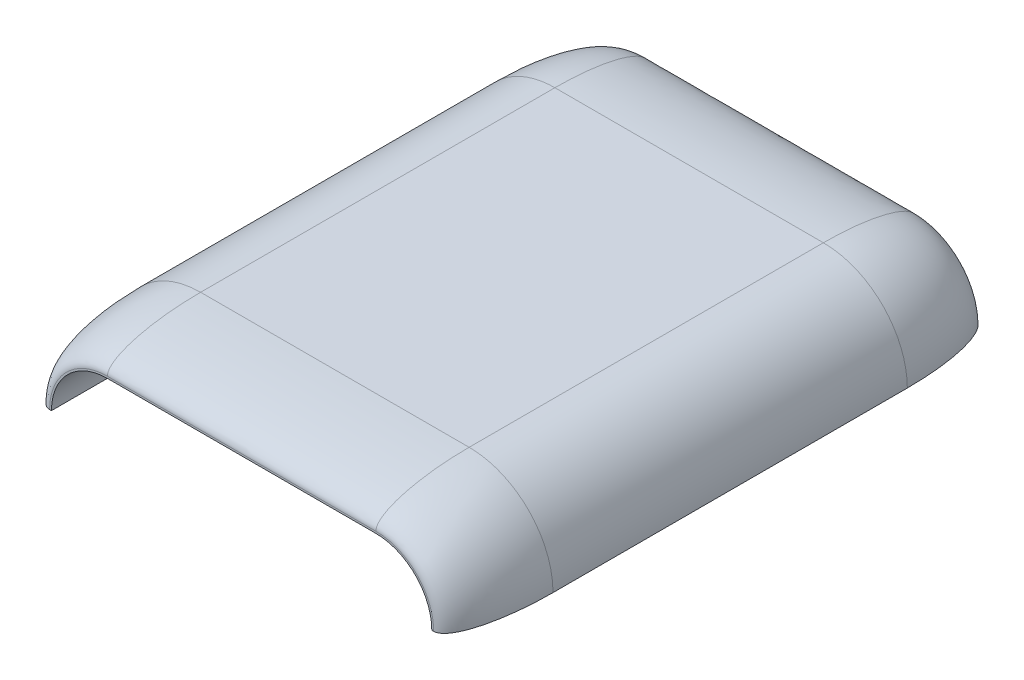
ISO-10303-21;
HEADER;
FILE_DESCRIPTION(('STEP AP214'),'2;1');
FILE_NAME('part.step','',(''),(''),'','','');
FILE_SCHEMA(('AUTOMOTIVE_DESIGN { 1 0 10303 214 1 1 1 1 }'));
ENDSEC;
DATA;
#1=APPLICATION_CONTEXT('core data for automotive mechanical design processes');
#2=APPLICATION_PROTOCOL_DEFINITION('international standard','automotive_design',2000,#1);
#3=PRODUCT_CONTEXT('',#1,'mechanical');
#4=PRODUCT('Part','Part','',(#3));
#5=PRODUCT_RELATED_PRODUCT_CATEGORY('part','',(#4));
#6=PRODUCT_DEFINITION_FORMATION('','',#4);
#7=PRODUCT_DEFINITION_CONTEXT('part definition',#1,'design');
#8=PRODUCT_DEFINITION('design','',#6,#7);
#9=PRODUCT_DEFINITION_SHAPE('','',#8);
#10=(LENGTH_UNIT() NAMED_UNIT(*) SI_UNIT(.MILLI.,.METRE.));
#11=(NAMED_UNIT(*) PLANE_ANGLE_UNIT() SI_UNIT($,.RADIAN.));
#12=(NAMED_UNIT(*) SI_UNIT($,.STERADIAN.) SOLID_ANGLE_UNIT());
#13=UNCERTAINTY_MEASURE_WITH_UNIT(LENGTH_MEASURE(1.E-05),#10,'distance_accuracy_value','');
#14=(GEOMETRIC_REPRESENTATION_CONTEXT(3) GLOBAL_UNCERTAINTY_ASSIGNED_CONTEXT((#13)) GLOBAL_UNIT_ASSIGNED_CONTEXT((#10,
#11,#12)) REPRESENTATION_CONTEXT('',''));
#15=CARTESIAN_POINT('',(0.,0.,0.));
#16=DIRECTION('',(0.,0.,1.));
#17=DIRECTION('',(1.,0.,0.));
#18=AXIS2_PLACEMENT_3D('',#15,#16,#17);
#19=CARTESIAN_POINT('',(7.20000000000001,0.,14.5));
#20=DIRECTION('',(0.,0.,-1.));
#21=DIRECTION('',(-1.,0.,0.));
#22=AXIS2_PLACEMENT_3D('',#19,#20,#21);
#23=CYLINDRICAL_SURFACE('',#22,2.99999999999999);
#24=CARTESIAN_POINT('',(7.20000000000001,0.,-14.5));
#25=DIRECTION('',(0.,0.,-1.));
#26=DIRECTION('',(1.,0.,0.));
#27=AXIS2_PLACEMENT_3D('',#24,#25,#26);
#28=CIRCLE('',#27,2.99999999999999);
#29=CARTESIAN_POINT('',(7.20000000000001,2.99999999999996,-14.5));
#30=VERTEX_POINT('',#29);
#31=CARTESIAN_POINT('',(10.2,0.,-14.5));
#32=VERTEX_POINT('',#31);
#33=EDGE_CURVE('E171',#30,#32,#28,.T.);
#34=ORIENTED_EDGE('',*,*,#33,.T.);
#35=DIRECTION('',(0.,0.,-1.));
#36=VECTOR('',#35,1.);
#37=CARTESIAN_POINT('',(10.2,0.,14.5));
#38=LINE('',#37,#36);
#39=CARTESIAN_POINT('',(10.2,0.,14.5));
#40=VERTEX_POINT('',#39);
#41=EDGE_CURVE('E149',#40,#32,#38,.T.);
#42=ORIENTED_EDGE('',*,*,#41,.F.);
#43=CARTESIAN_POINT('',(7.20000000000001,0.,14.5));
#44=DIRECTION('',(0.,0.,-1.));
#45=DIRECTION('',(1.,0.,0.));
#46=AXIS2_PLACEMENT_3D('',#43,#44,#45);
#47=CIRCLE('',#46,2.99999999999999);
#48=CARTESIAN_POINT('',(7.20000000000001,2.99999999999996,14.5));
#49=VERTEX_POINT('',#48);
#50=EDGE_CURVE('E159',#49,#40,#47,.T.);
#51=ORIENTED_EDGE('',*,*,#50,.F.);
#52=DIRECTION('',(0.,0.,-1.));
#53=VECTOR('',#52,1.);
#54=CARTESIAN_POINT('',(7.20000000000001,2.99999999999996,14.5));
#55=LINE('',#54,#53);
#56=EDGE_CURVE('E192',#49,#30,#55,.T.);
#57=ORIENTED_EDGE('',*,*,#56,.T.);
#58=EDGE_LOOP('',(#34,#42,#51,#57));
#59=FACE_BOUND('',#58,.T.);
#60=ADVANCED_FACE('F47',(#59),#23,.F.);
#61=CARTESIAN_POINT('',(10.2,0.,14.5));
#62=DIRECTION('',(0.,1.,0.));
#63=DIRECTION('',(0.,0.,1.));
#64=AXIS2_PLACEMENT_3D('',#61,#62,#63);
#65=PLANE('',#64);
#66=DIRECTION('',(1.,0.,0.));
#67=VECTOR('',#66,1.);
#68=CARTESIAN_POINT('',(10.2,0.,-14.5));
#69=LINE('',#68,#67);
#70=CARTESIAN_POINT('',(10.2999147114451,0.,-14.5));
#71=VERTEX_POINT('',#70);
#72=EDGE_CURVE('E194',#32,#71,#69,.T.);
#73=ORIENTED_EDGE('',*,*,#72,.T.);
#74=CARTESIAN_POINT('',(11.6998761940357,0.,-9.5));
#75=CARTESIAN_POINT('',(11.6998761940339,0.,-14.5));
#76=CARTESIAN_POINT('',(10.2999147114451,0.,-14.5));
#77=(BOUNDED_CURVE() B_SPLINE_CURVE(2,(#74,#75,#76),.UNSPECIFIED.,.F.,
.F.) B_SPLINE_CURVE_WITH_KNOTS((3,3),(0.,1.),
.UNSPECIFIED.) CURVE() GEOMETRIC_REPRESENTATION_ITEM() RATIONAL_B_SPLINE_CURVE((1.,
0.707106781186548,1.)) REPRESENTATION_ITEM(''));
#78=CARTESIAN_POINT('',(11.6999380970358,-3.33195933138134E-08,-9.5));
#79=VERTEX_POINT('',#78);
#80=EDGE_CURVE('E252',#71,#79,#77,.F.);
#81=ORIENTED_EDGE('',*,*,#80,.T.);
#82=DIRECTION('',(0.,0.,-1.));
#83=VECTOR('',#82,1.);
#84=CARTESIAN_POINT('',(11.7,0.,14.5));
#85=LINE('',#84,#83);
#86=CARTESIAN_POINT('',(11.6999380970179,0.,9.5));
#87=VERTEX_POINT('',#86);
#88=EDGE_CURVE('E173',#87,#79,#85,.T.);
#89=ORIENTED_EDGE('',*,*,#88,.F.);
#90=CARTESIAN_POINT('',(10.2999147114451,0.,14.5));
#91=CARTESIAN_POINT('',(11.6998761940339,0.,14.5));
#92=CARTESIAN_POINT('',(11.6998761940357,0.,9.5));
#93=(BOUNDED_CURVE() B_SPLINE_CURVE(2,(#90,#91,#92),.UNSPECIFIED.,.F.,
.F.) B_SPLINE_CURVE_WITH_KNOTS((3,3),(0.,1.),
.UNSPECIFIED.) CURVE() GEOMETRIC_REPRESENTATION_ITEM() RATIONAL_B_SPLINE_CURVE((1.,
0.707106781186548,1.)) REPRESENTATION_ITEM(''));
#94=CARTESIAN_POINT('',(10.2999147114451,0.,14.5));
#95=VERTEX_POINT('',#94);
#96=EDGE_CURVE('E153',#87,#95,#93,.F.);
#97=ORIENTED_EDGE('',*,*,#96,.T.);
#98=DIRECTION('',(1.,0.,0.));
#99=VECTOR('',#98,1.);
#100=CARTESIAN_POINT('',(10.2,0.,14.5));
#101=LINE('',#100,#99);
#102=EDGE_CURVE('E144',#40,#95,#101,.T.);
#103=ORIENTED_EDGE('',*,*,#102,.F.);
#104=ORIENTED_EDGE('',*,*,#41,.T.);
#105=EDGE_LOOP('',(#73,#81,#89,#97,#103,#104));
#106=FACE_BOUND('',#105,.T.);
#107=ADVANCED_FACE('F147',(#106),#65,.F.);
#108=CARTESIAN_POINT('',(7.20000000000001,0.,14.5));
#109=DIRECTION('',(0.,0.,-1.));
#110=DIRECTION('',(-1.,0.,0.));
#111=AXIS2_PLACEMENT_3D('',#108,#109,#110);
#112=CYLINDRICAL_SURFACE('',#111,4.49999999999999);
#113=ORIENTED_EDGE('',*,*,#88,.T.);
#114=CARTESIAN_POINT('',(7.20000000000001,4.49999999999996,-9.5));
#115=CARTESIAN_POINT('',(7.81863646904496,4.49999999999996,-9.5));
#116=CARTESIAN_POINT('',(8.43670654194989,4.37070937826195,-9.5));
#117=CARTESIAN_POINT('',(9.57003295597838,3.8749822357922,-9.5));
#118=CARTESIAN_POINT('',(10.0846123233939,3.50878259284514,-9.5));
#119=CARTESIAN_POINT('',(10.9242902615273,2.60042411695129,-9.5));
#120=CARTESIAN_POINT('',(11.2489876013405,2.05869933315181,-9.5));
#121=CARTESIAN_POINT('',(11.6542668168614,0.889972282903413,-9.5));
#122=CARTESIAN_POINT('',(11.7346656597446,0.263663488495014,-9.5));
#123=CARTESIAN_POINT('',(11.6861280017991,-0.353065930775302,-9.5));
#124=(BOUNDED_CURVE() B_SPLINE_CURVE(3,(#114,#115,#116,#117,#118,#119,#120,#121,#122,#123),
.UNSPECIFIED.,.F.,.F.) B_SPLINE_CURVE_WITH_KNOTS((4,2,2,2,4),(-0.0785398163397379,
0.333794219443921,0.746128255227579,1.15846229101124,1.5707963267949),
.UNSPECIFIED.) CURVE() GEOMETRIC_REPRESENTATION_ITEM() RATIONAL_B_SPLINE_CURVE((1.,1.,1.,1.,1.,
1.,1.,1.,1.,1.)) REPRESENTATION_ITEM(''));
#125=CARTESIAN_POINT('',(7.20000000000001,4.49999999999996,-9.49999999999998));
#126=VERTEX_POINT('',#125);
#127=EDGE_CURVE('E403',#79,#126,#124,.F.);
#128=ORIENTED_EDGE('',*,*,#127,.T.);
#129=DIRECTION('',(0.,0.,-1.));
#130=VECTOR('',#129,1.);
#131=CARTESIAN_POINT('',(7.20000000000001,4.49999999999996,14.5));
#132=LINE('',#131,#130);
#133=CARTESIAN_POINT('',(7.20000000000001,4.49999999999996,9.50000000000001));
#134=VERTEX_POINT('',#133);
#135=EDGE_CURVE('E177',#134,#126,#132,.T.);
#136=ORIENTED_EDGE('',*,*,#135,.F.);
#137=CARTESIAN_POINT('',(11.6861280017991,-0.353065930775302,9.5));
#138=CARTESIAN_POINT('',(11.7346656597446,0.263663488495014,9.5));
#139=CARTESIAN_POINT('',(11.6542668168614,0.889972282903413,9.5));
#140=CARTESIAN_POINT('',(11.2489876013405,2.05869933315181,9.5));
#141=CARTESIAN_POINT('',(10.9242902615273,2.60042411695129,9.5));
#142=CARTESIAN_POINT('',(10.0846123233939,3.50878259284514,9.5));
#143=CARTESIAN_POINT('',(9.57003295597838,3.8749822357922,9.5));
#144=CARTESIAN_POINT('',(8.43670654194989,4.37070937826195,9.5));
#145=CARTESIAN_POINT('',(7.81863646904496,4.49999999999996,9.5));
#146=CARTESIAN_POINT('',(7.20000000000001,4.49999999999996,9.5));
#147=(BOUNDED_CURVE() B_SPLINE_CURVE(3,(#137,#138,#139,#140,#141,#142,#143,#144,#145,#146),
.UNSPECIFIED.,.F.,.F.) B_SPLINE_CURVE_WITH_KNOTS((4,2,2,2,4),(-0.0785398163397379,
0.333794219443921,0.746128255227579,1.15846229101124,1.5707963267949),
.UNSPECIFIED.) CURVE() GEOMETRIC_REPRESENTATION_ITEM() RATIONAL_B_SPLINE_CURVE((1.,1.,1.,1.,1.,
1.,1.,1.,1.,1.)) REPRESENTATION_ITEM(''));
#148=EDGE_CURVE('E497',#134,#87,#147,.F.);
#149=ORIENTED_EDGE('',*,*,#148,.T.);
#150=EDGE_LOOP('',(#113,#128,#136,#149));
#151=FACE_BOUND('',#150,.T.);
#152=ADVANCED_FACE('F266',(#151),#112,.T.);
#153=CARTESIAN_POINT('',(-7.20000000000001,4.49999999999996,14.5));
#154=DIRECTION('',(0.,-1.,0.));
#155=DIRECTION('',(0.,0.,-1.));
#156=AXIS2_PLACEMENT_3D('',#153,#154,#155);
#157=PLANE('',#156);
#158=ORIENTED_EDGE('',*,*,#135,.T.);
#159=CARTESIAN_POINT('',(-7.20000000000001,4.49999999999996,-9.5));
#160=CARTESIAN_POINT('',(-2.4,4.49999999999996,-9.5));
#161=CARTESIAN_POINT('',(2.4,4.49999999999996,-9.5));
#162=CARTESIAN_POINT('',(7.20000000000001,4.49999999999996,-9.5));
#163=(BOUNDED_CURVE() B_SPLINE_CURVE(3,(#159,#160,#161,#162),.UNSPECIFIED.,.F.,
.F.) B_SPLINE_CURVE_WITH_KNOTS((4,4),(-0.0144,0.),
.UNSPECIFIED.) CURVE() GEOMETRIC_REPRESENTATION_ITEM() RATIONAL_B_SPLINE_CURVE((1.,1.,1.,1.)) REPRESENTATION_ITEM(''));
#164=CARTESIAN_POINT('',(-7.20000000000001,4.49999999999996,-9.49999999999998));
#165=VERTEX_POINT('',#164);
#166=EDGE_CURVE('E12',#126,#165,#163,.F.);
#167=ORIENTED_EDGE('',*,*,#166,.T.);
#168=DIRECTION('',(0.,0.,-1.));
#169=VECTOR('',#168,1.);
#170=CARTESIAN_POINT('',(-7.20000000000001,4.49999999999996,14.5));
#171=LINE('',#170,#169);
#172=CARTESIAN_POINT('',(-7.20000000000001,4.49999999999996,9.50000000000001));
#173=VERTEX_POINT('',#172);
#174=EDGE_CURVE('E284',#173,#165,#171,.T.);
#175=ORIENTED_EDGE('',*,*,#174,.F.);
#176=CARTESIAN_POINT('',(7.20000000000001,4.49999999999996,9.5));
#177=CARTESIAN_POINT('',(2.4,4.49999999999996,9.5));
#178=CARTESIAN_POINT('',(-2.4,4.49999999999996,9.5));
#179=CARTESIAN_POINT('',(-7.20000000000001,4.49999999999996,9.5));
#180=(BOUNDED_CURVE() B_SPLINE_CURVE(3,(#176,#177,#178,#179),.UNSPECIFIED.,.F.,
.F.) B_SPLINE_CURVE_WITH_KNOTS((4,4),(-0.0144,0.),
.UNSPECIFIED.) CURVE() GEOMETRIC_REPRESENTATION_ITEM() RATIONAL_B_SPLINE_CURVE((1.,1.,1.,1.)) REPRESENTATION_ITEM(''));
#181=EDGE_CURVE('E438',#173,#134,#180,.F.);
#182=ORIENTED_EDGE('',*,*,#181,.T.);
#183=EDGE_LOOP('',(#158,#167,#175,#182));
#184=FACE_BOUND('',#183,.T.);
#185=ADVANCED_FACE('F315',(#184),#157,.F.);
#186=CARTESIAN_POINT('',(-7.20000000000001,0.,14.5));
#187=DIRECTION('',(0.,0.,-1.));
#188=DIRECTION('',(-1.,0.,0.));
#189=AXIS2_PLACEMENT_3D('',#186,#187,#188);
#190=CYLINDRICAL_SURFACE('',#189,4.49999999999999);
#191=ORIENTED_EDGE('',*,*,#174,.T.);
#192=CARTESIAN_POINT('',(-11.6861280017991,-0.353065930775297,-9.5));
#193=CARTESIAN_POINT('',(-11.7346656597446,0.263663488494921,-9.5));
#194=CARTESIAN_POINT('',(-11.6542668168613,0.889972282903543,-9.5));
#195=CARTESIAN_POINT('',(-11.2489876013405,2.05869933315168,-9.5));
#196=CARTESIAN_POINT('',(-10.924290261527,2.60042411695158,-9.5));
#197=CARTESIAN_POINT('',(-10.0846123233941,3.50878259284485,-9.5));
#198=CARTESIAN_POINT('',(-9.57003295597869,3.87498223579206,-9.5));
#199=CARTESIAN_POINT('',(-8.43670654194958,4.37070937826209,-9.5));
#200=CARTESIAN_POINT('',(-7.81863646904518,4.49999999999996,-9.5));
#201=CARTESIAN_POINT('',(-7.20000000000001,4.49999999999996,-9.5));
#202=(BOUNDED_CURVE() B_SPLINE_CURVE(3,(#192,#193,#194,#195,#196,#197,#198,#199,#200,#201),
.UNSPECIFIED.,.F.,.F.) B_SPLINE_CURVE_WITH_KNOTS((4,2,2,2,4),(1.5707963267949,1.98313036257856,
2.39546439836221,2.80779843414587,3.22013246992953),
.UNSPECIFIED.) CURVE() GEOMETRIC_REPRESENTATION_ITEM() RATIONAL_B_SPLINE_CURVE((1.,1.,1.,1.,1.,
1.,1.,1.,1.,1.)) REPRESENTATION_ITEM(''));
#203=CARTESIAN_POINT('',(-11.6999380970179,0.,-9.5));
#204=VERTEX_POINT('',#203);
#205=EDGE_CURVE('E73',#165,#204,#202,.F.);
#206=ORIENTED_EDGE('',*,*,#205,.T.);
#207=DIRECTION('',(0.,0.,-1.));
#208=VECTOR('',#207,1.);
#209=CARTESIAN_POINT('',(-11.7,0.,14.5));
#210=LINE('',#209,#208);
#211=CARTESIAN_POINT('',(-11.6999380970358,-3.33195942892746E-08,9.5));
#212=VERTEX_POINT('',#211);
#213=EDGE_CURVE('E276',#212,#204,#210,.T.);
#214=ORIENTED_EDGE('',*,*,#213,.F.);
#215=CARTESIAN_POINT('',(-7.20000000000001,4.49999999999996,9.5));
#216=CARTESIAN_POINT('',(-7.81863646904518,4.49999999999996,9.5));
#217=CARTESIAN_POINT('',(-8.43670654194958,4.37070937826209,9.5));
#218=CARTESIAN_POINT('',(-9.57003295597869,3.87498223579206,9.5));
#219=CARTESIAN_POINT('',(-10.0846123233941,3.50878259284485,9.5));
#220=CARTESIAN_POINT('',(-10.924290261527,2.60042411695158,9.5));
#221=CARTESIAN_POINT('',(-11.2489876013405,2.05869933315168,9.5));
#222=CARTESIAN_POINT('',(-11.6542668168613,0.889972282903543,9.5));
#223=CARTESIAN_POINT('',(-11.7346656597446,0.263663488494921,9.5));
#224=CARTESIAN_POINT('',(-11.6861280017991,-0.353065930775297,9.5));
#225=(BOUNDED_CURVE() B_SPLINE_CURVE(3,(#215,#216,#217,#218,#219,#220,#221,#222,#223,#224),
.UNSPECIFIED.,.F.,.F.) B_SPLINE_CURVE_WITH_KNOTS((4,2,2,2,4),(1.5707963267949,1.98313036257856,
2.39546439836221,2.80779843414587,3.22013246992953),
.UNSPECIFIED.) CURVE() GEOMETRIC_REPRESENTATION_ITEM() RATIONAL_B_SPLINE_CURVE((1.,1.,1.,1.,1.,
1.,1.,1.,1.,1.)) REPRESENTATION_ITEM(''));
#226=EDGE_CURVE('E300',#212,#173,#225,.F.);
#227=ORIENTED_EDGE('',*,*,#226,.T.);
#228=EDGE_LOOP('',(#191,#206,#214,#227));
#229=FACE_BOUND('',#228,.T.);
#230=ADVANCED_FACE('F306',(#229),#190,.T.);
#231=CARTESIAN_POINT('',(-11.7,0.,14.5));
#232=DIRECTION('',(0.,1.,0.));
#233=DIRECTION('',(0.,0.,1.));
#234=AXIS2_PLACEMENT_3D('',#231,#232,#233);
#235=PLANE('',#234);
#236=ORIENTED_EDGE('',*,*,#213,.T.);
#237=CARTESIAN_POINT('',(-10.2999147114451,0.,-14.5));
#238=CARTESIAN_POINT('',(-11.6998761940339,0.,-14.5));
#239=CARTESIAN_POINT('',(-11.6998761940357,0.,-9.5));
#240=(BOUNDED_CURVE() B_SPLINE_CURVE(2,(#237,#238,#239),.UNSPECIFIED.,.F.,
.F.) B_SPLINE_CURVE_WITH_KNOTS((3,3),(0.,1.),
.UNSPECIFIED.) CURVE() GEOMETRIC_REPRESENTATION_ITEM() RATIONAL_B_SPLINE_CURVE((1.,
0.707106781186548,1.)) REPRESENTATION_ITEM(''));
#241=CARTESIAN_POINT('',(-10.2999147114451,0.,-14.5));
#242=VERTEX_POINT('',#241);
#243=EDGE_CURVE('E60',#204,#242,#240,.F.);
#244=ORIENTED_EDGE('',*,*,#243,.T.);
#245=DIRECTION('',(1.,0.,0.));
#246=VECTOR('',#245,1.);
#247=CARTESIAN_POINT('',(-11.7,0.,-14.5));
#248=LINE('',#247,#246);
#249=CARTESIAN_POINT('',(-10.2,0.,-14.5));
#250=VERTEX_POINT('',#249);
#251=EDGE_CURVE('E203',#242,#250,#248,.T.);
#252=ORIENTED_EDGE('',*,*,#251,.T.);
#253=DIRECTION('',(0.,0.,-1.));
#254=VECTOR('',#253,1.);
#255=CARTESIAN_POINT('',(-10.2,0.,14.5));
#256=LINE('',#255,#254);
#257=CARTESIAN_POINT('',(-10.2,0.,14.5));
#258=VERTEX_POINT('',#257);
#259=EDGE_CURVE('E285',#258,#250,#256,.T.);
#260=ORIENTED_EDGE('',*,*,#259,.F.);
#261=DIRECTION('',(1.,0.,0.));
#262=VECTOR('',#261,1.);
#263=CARTESIAN_POINT('',(-11.7,0.,14.5));
#264=LINE('',#263,#262);
#265=CARTESIAN_POINT('',(-10.2999147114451,0.,14.5));
#266=VERTEX_POINT('',#265);
#267=EDGE_CURVE('E158',#266,#258,#264,.T.);
#268=ORIENTED_EDGE('',*,*,#267,.F.);
#269=CARTESIAN_POINT('',(-11.6998761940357,0.,9.5));
#270=CARTESIAN_POINT('',(-11.6998761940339,0.,14.5));
#271=CARTESIAN_POINT('',(-10.2999147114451,0.,14.5));
#272=(BOUNDED_CURVE() B_SPLINE_CURVE(2,(#269,#270,#271),.UNSPECIFIED.,.F.,
.F.) B_SPLINE_CURVE_WITH_KNOTS((3,3),(0.,1.),
.UNSPECIFIED.) CURVE() GEOMETRIC_REPRESENTATION_ITEM() RATIONAL_B_SPLINE_CURVE((1.,
0.707106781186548,1.)) REPRESENTATION_ITEM(''));
#273=EDGE_CURVE('E493',#266,#212,#272,.F.);
#274=ORIENTED_EDGE('',*,*,#273,.T.);
#275=EDGE_LOOP('',(#236,#244,#252,#260,#268,#274));
#276=FACE_BOUND('',#275,.T.);
#277=ADVANCED_FACE('F314',(#276),#235,.F.);
#278=CARTESIAN_POINT('',(-7.20000000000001,0.,14.5));
#279=DIRECTION('',(0.,0.,-1.));
#280=DIRECTION('',(-1.,0.,0.));
#281=AXIS2_PLACEMENT_3D('',#278,#279,#280);
#282=CYLINDRICAL_SURFACE('',#281,2.99999999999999);
#283=CARTESIAN_POINT('',(-7.20000000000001,0.,-14.5));
#284=DIRECTION('',(0.,0.,-1.));
#285=DIRECTION('',(1.,0.,0.));
#286=AXIS2_PLACEMENT_3D('',#283,#284,#285);
#287=CIRCLE('',#286,2.99999999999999);
#288=CARTESIAN_POINT('',(-7.20000000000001,2.99999999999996,-14.5));
#289=VERTEX_POINT('',#288);
#290=EDGE_CURVE('E515',#250,#289,#287,.T.);
#291=ORIENTED_EDGE('',*,*,#290,.T.);
#292=DIRECTION('',(0.,0.,-1.));
#293=VECTOR('',#292,1.);
#294=CARTESIAN_POINT('',(-7.20000000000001,2.99999999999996,14.5));
#295=LINE('',#294,#293);
#296=CARTESIAN_POINT('',(-7.20000000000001,2.99999999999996,14.5));
#297=VERTEX_POINT('',#296);
#298=EDGE_CURVE('E511',#297,#289,#295,.T.);
#299=ORIENTED_EDGE('',*,*,#298,.F.);
#300=CARTESIAN_POINT('',(-7.20000000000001,0.,14.5));
#301=DIRECTION('',(0.,0.,-1.));
#302=DIRECTION('',(1.,0.,0.));
#303=AXIS2_PLACEMENT_3D('',#300,#301,#302);
#304=CIRCLE('',#303,2.99999999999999);
#305=EDGE_CURVE('E189',#258,#297,#304,.T.);
#306=ORIENTED_EDGE('',*,*,#305,.F.);
#307=ORIENTED_EDGE('',*,*,#259,.T.);
#308=EDGE_LOOP('',(#291,#299,#306,#307));
#309=FACE_BOUND('',#308,.T.);
#310=ADVANCED_FACE('F513',(#309),#282,.F.);
#311=CARTESIAN_POINT('',(-7.20000000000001,2.99999999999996,14.5));
#312=DIRECTION('',(0.,1.,0.));
#313=DIRECTION('',(0.,0.,1.));
#314=AXIS2_PLACEMENT_3D('',#311,#312,#313);
#315=PLANE('',#314);
#316=CARTESIAN_POINT('',(0.,2.99999999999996,-7.5));
#317=DIRECTION('',(0.,1.,0.));
#318=DIRECTION('',(0.,0.,1.));
#319=AXIS2_PLACEMENT_3D('',#316,#317,#318);
#320=CIRCLE('',#319,2.4);
#321=CARTESIAN_POINT('',(0.,2.99999999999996,-5.1));
#322=VERTEX_POINT('',#321);
#323=EDGE_CURVE('E432',#322,#322,#320,.F.);
#324=ORIENTED_EDGE('',*,*,#323,.F.);
#325=EDGE_LOOP('',(#324));
#326=FACE_BOUND('',#325,.T.);
#327=CARTESIAN_POINT('',(0.,2.99999999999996,7.5));
#328=DIRECTION('',(0.,1.,0.));
#329=DIRECTION('',(0.,0.,1.));
#330=AXIS2_PLACEMENT_3D('',#327,#328,#329);
#331=CIRCLE('',#330,2.4);
#332=CARTESIAN_POINT('',(0.,2.99999999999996,9.9));
#333=VERTEX_POINT('',#332);
#334=EDGE_CURVE('E435',#333,#333,#331,.F.);
#335=ORIENTED_EDGE('',*,*,#334,.F.);
#336=EDGE_LOOP('',(#335));
#337=FACE_BOUND('',#336,.T.);
#338=DIRECTION('',(1.,0.,0.));
#339=VECTOR('',#338,1.);
#340=CARTESIAN_POINT('',(-7.20000000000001,2.99999999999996,-14.5));
#341=LINE('',#340,#339);
#342=EDGE_CURVE('E168',#289,#30,#341,.T.);
#343=ORIENTED_EDGE('',*,*,#342,.T.);
#344=ORIENTED_EDGE('',*,*,#56,.F.);
#345=DIRECTION('',(1.,0.,0.));
#346=VECTOR('',#345,1.);
#347=CARTESIAN_POINT('',(-7.20000000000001,2.99999999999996,14.5));
#348=LINE('',#347,#346);
#349=EDGE_CURVE('E164',#297,#49,#348,.T.);
#350=ORIENTED_EDGE('',*,*,#349,.F.);
#351=ORIENTED_EDGE('',*,*,#298,.T.);
#352=EDGE_LOOP('',(#343,#344,#350,#351));
#353=FACE_BOUND('',#352,.T.);
#354=ADVANCED_FACE('F228',(#326,#337,#353),#315,.F.);
#355=CARTESIAN_POINT('',(7.20000000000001,0.,14.5));
#356=DIRECTION('',(0.,0.,1.));
#357=DIRECTION('',(1.,0.,0.));
#358=AXIS2_PLACEMENT_3D('',#355,#356,#357);
#359=PLANE('',#358);
#360=ORIENTED_EDGE('',*,*,#102,.T.);
#361=CARTESIAN_POINT('',(7.20000000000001,3.09999999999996,14.5));
#362=CARTESIAN_POINT('',(7.62617178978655,3.09999999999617,14.5));
#363=CARTESIAN_POINT('',(8.05195339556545,3.01093312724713,14.5));
#364=CARTESIAN_POINT('',(8.83268936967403,2.66943220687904,14.5));
#365=CARTESIAN_POINT('',(9.18717737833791,2.41716134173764,14.5));
#366=CARTESIAN_POINT('',(9.76562218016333,1.79140328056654,14.5));
#367=CARTESIAN_POINT('',(9.98930256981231,1.41821509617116,14.5));
#368=CARTESIAN_POINT('',(10.2684949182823,0.613092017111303,14.5));
#369=CARTESIAN_POINT('',(10.3238807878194,0.181634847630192,14.5));
#370=CARTESIAN_POINT('',(10.2904437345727,-0.243223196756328,14.5));
#371=(BOUNDED_CURVE() B_SPLINE_CURVE(3,(#361,#362,#363,#364,#365,#366,#367,#368,#369,#370),
.UNSPECIFIED.,.F.,.F.) B_SPLINE_CURVE_WITH_KNOTS((4,2,2,2,4),(-0.0785398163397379,
0.333794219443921,0.746128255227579,1.15846229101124,1.5707963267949),
.UNSPECIFIED.) CURVE() GEOMETRIC_REPRESENTATION_ITEM() RATIONAL_B_SPLINE_CURVE((1.,1.,1.,1.,1.,
1.,1.,1.,1.,1.)) REPRESENTATION_ITEM(''));
#372=CARTESIAN_POINT('',(7.20000000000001,3.09999999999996,14.5));
#373=VERTEX_POINT('',#372);
#374=EDGE_CURVE('E498',#95,#373,#371,.F.);
#375=ORIENTED_EDGE('',*,*,#374,.T.);
#376=CARTESIAN_POINT('',(-7.20000000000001,3.09999999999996,14.5));
#377=CARTESIAN_POINT('',(-2.4,3.09999999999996,14.5));
#378=CARTESIAN_POINT('',(2.4,3.09999999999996,14.5));
#379=CARTESIAN_POINT('',(7.20000000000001,3.09999999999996,14.5));
#380=(BOUNDED_CURVE() B_SPLINE_CURVE(3,(#376,#377,#378,#379),.UNSPECIFIED.,.F.,
.F.) B_SPLINE_CURVE_WITH_KNOTS((4,4),(-0.0144,0.),
.UNSPECIFIED.) CURVE() GEOMETRIC_REPRESENTATION_ITEM() RATIONAL_B_SPLINE_CURVE((1.,1.,1.,1.)) REPRESENTATION_ITEM(''));
#381=CARTESIAN_POINT('',(-7.20000000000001,3.09999999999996,14.5));
#382=VERTEX_POINT('',#381);
#383=EDGE_CURVE('E172',#373,#382,#380,.F.);
#384=ORIENTED_EDGE('',*,*,#383,.T.);
#385=CARTESIAN_POINT('',(-10.2904437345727,-0.243223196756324,14.5));
#386=CARTESIAN_POINT('',(-10.3238807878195,0.181634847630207,14.5));
#387=CARTESIAN_POINT('',(-10.2684949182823,0.613092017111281,14.5));
#388=CARTESIAN_POINT('',(-9.98930256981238,1.41821509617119,14.5));
#389=CARTESIAN_POINT('',(-9.76562218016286,1.79140328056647,14.5));
#390=CARTESIAN_POINT('',(-9.18717737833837,2.41716134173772,14.5));
#391=CARTESIAN_POINT('',(-8.83268936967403,2.66943220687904,14.5));
#392=CARTESIAN_POINT('',(-8.05195339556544,3.01093312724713,14.5));
#393=CARTESIAN_POINT('',(-7.62617178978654,3.09999999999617,14.5));
#394=CARTESIAN_POINT('',(-7.20000000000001,3.09999999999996,14.5));
#395=(BOUNDED_CURVE() B_SPLINE_CURVE(3,(#385,#386,#387,#388,#389,#390,#391,#392,#393,#394),
.UNSPECIFIED.,.F.,.F.) B_SPLINE_CURVE_WITH_KNOTS((4,2,2,2,4),(1.5707963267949,1.98313036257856,
2.39546439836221,2.80779843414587,3.22013246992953),
.UNSPECIFIED.) CURVE() GEOMETRIC_REPRESENTATION_ITEM() RATIONAL_B_SPLINE_CURVE((1.,1.,1.,1.,1.,
1.,1.,1.,1.,1.)) REPRESENTATION_ITEM(''));
#396=EDGE_CURVE('E175',#382,#266,#395,.F.);
#397=ORIENTED_EDGE('',*,*,#396,.T.);
#398=ORIENTED_EDGE('',*,*,#267,.T.);
#399=ORIENTED_EDGE('',*,*,#305,.T.);
#400=ORIENTED_EDGE('',*,*,#349,.T.);
#401=ORIENTED_EDGE('',*,*,#50,.T.);
#402=EDGE_LOOP('',(#360,#375,#384,#397,#398,#399,#400,#401));
#403=FACE_BOUND('',#402,.T.);
#404=ADVANCED_FACE('F162',(#403),#359,.T.);
#405=CARTESIAN_POINT('',(7.20000000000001,0.,-14.5));
#406=DIRECTION('',(0.,0.,1.));
#407=DIRECTION('',(1.,0.,0.));
#408=AXIS2_PLACEMENT_3D('',#405,#406,#407);
#409=PLANE('',#408);
#410=CARTESIAN_POINT('',(7.20000000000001,3.09999999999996,-14.5));
#411=CARTESIAN_POINT('',(2.4,3.09999999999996,-14.5));
#412=CARTESIAN_POINT('',(-2.4,3.09999999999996,-14.5));
#413=CARTESIAN_POINT('',(-7.20000000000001,3.09999999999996,-14.5));
#414=(BOUNDED_CURVE() B_SPLINE_CURVE(3,(#410,#411,#412,#413),.UNSPECIFIED.,.F.,
.F.) B_SPLINE_CURVE_WITH_KNOTS((4,4),(-0.0144,0.),
.UNSPECIFIED.) CURVE() GEOMETRIC_REPRESENTATION_ITEM() RATIONAL_B_SPLINE_CURVE((1.,1.,1.,1.)) REPRESENTATION_ITEM(''));
#415=CARTESIAN_POINT('',(-7.20000000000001,3.09999999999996,-14.5));
#416=VERTEX_POINT('',#415);
#417=CARTESIAN_POINT('',(7.20000000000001,3.09999999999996,-14.5));
#418=VERTEX_POINT('',#417);
#419=EDGE_CURVE('E208',#416,#418,#414,.F.);
#420=ORIENTED_EDGE('',*,*,#419,.T.);
#421=CARTESIAN_POINT('',(10.2904437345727,-0.243223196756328,-14.5));
#422=CARTESIAN_POINT('',(10.3238807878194,0.181634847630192,-14.5));
#423=CARTESIAN_POINT('',(10.2684949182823,0.613092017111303,-14.5));
#424=CARTESIAN_POINT('',(9.98930256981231,1.41821509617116,-14.5));
#425=CARTESIAN_POINT('',(9.76562218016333,1.79140328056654,-14.5));
#426=CARTESIAN_POINT('',(9.18717737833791,2.41716134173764,-14.5));
#427=CARTESIAN_POINT('',(8.83268936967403,2.66943220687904,-14.5));
#428=CARTESIAN_POINT('',(8.05195339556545,3.01093312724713,-14.5));
#429=CARTESIAN_POINT('',(7.62617178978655,3.09999999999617,-14.5));
#430=CARTESIAN_POINT('',(7.20000000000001,3.09999999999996,-14.5));
#431=(BOUNDED_CURVE() B_SPLINE_CURVE(3,(#421,#422,#423,#424,#425,#426,#427,#428,#429,#430),
.UNSPECIFIED.,.F.,.F.) B_SPLINE_CURVE_WITH_KNOTS((4,2,2,2,4),(-0.0785398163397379,
0.333794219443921,0.746128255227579,1.15846229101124,1.5707963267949),
.UNSPECIFIED.) CURVE() GEOMETRIC_REPRESENTATION_ITEM() RATIONAL_B_SPLINE_CURVE((1.,1.,1.,1.,1.,
1.,1.,1.,1.,1.)) REPRESENTATION_ITEM(''));
#432=EDGE_CURVE('E241',#418,#71,#431,.F.);
#433=ORIENTED_EDGE('',*,*,#432,.T.);
#434=ORIENTED_EDGE('',*,*,#72,.F.);
#435=ORIENTED_EDGE('',*,*,#33,.F.);
#436=ORIENTED_EDGE('',*,*,#342,.F.);
#437=ORIENTED_EDGE('',*,*,#290,.F.);
#438=ORIENTED_EDGE('',*,*,#251,.F.);
#439=CARTESIAN_POINT('',(-7.20000000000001,3.09999999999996,-14.5));
#440=CARTESIAN_POINT('',(-7.62617178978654,3.09999999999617,-14.5));
#441=CARTESIAN_POINT('',(-8.05195339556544,3.01093312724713,-14.5));
#442=CARTESIAN_POINT('',(-8.83268936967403,2.66943220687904,-14.5));
#443=CARTESIAN_POINT('',(-9.18717737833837,2.41716134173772,-14.5));
#444=CARTESIAN_POINT('',(-9.76562218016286,1.79140328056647,-14.5));
#445=CARTESIAN_POINT('',(-9.98930256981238,1.41821509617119,-14.5));
#446=CARTESIAN_POINT('',(-10.2684949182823,0.613092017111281,-14.5));
#447=CARTESIAN_POINT('',(-10.3238807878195,0.181634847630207,-14.5));
#448=CARTESIAN_POINT('',(-10.2904437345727,-0.243223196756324,-14.5));
#449=(BOUNDED_CURVE() B_SPLINE_CURVE(3,(#439,#440,#441,#442,#443,#444,#445,#446,#447,#448),
.UNSPECIFIED.,.F.,.F.) B_SPLINE_CURVE_WITH_KNOTS((4,2,2,2,4),(1.5707963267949,1.98313036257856,
2.39546439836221,2.80779843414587,3.22013246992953),
.UNSPECIFIED.) CURVE() GEOMETRIC_REPRESENTATION_ITEM() RATIONAL_B_SPLINE_CURVE((1.,1.,1.,1.,1.,
1.,1.,1.,1.,1.)) REPRESENTATION_ITEM(''));
#450=EDGE_CURVE('E404',#242,#416,#449,.F.);
#451=ORIENTED_EDGE('',*,*,#450,.T.);
#452=EDGE_LOOP('',(#420,#433,#434,#435,#436,#437,#438,#451));
#453=FACE_BOUND('',#452,.T.);
#454=ADVANCED_FACE('F215',(#453),#409,.F.);
#455=CARTESIAN_POINT('',(-7.20000000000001,3.09999999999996,14.5));
#456=CARTESIAN_POINT('',(-7.62617178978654,3.09999999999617,14.5));
#457=CARTESIAN_POINT('',(-8.05195339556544,3.01093312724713,14.5));
#458=CARTESIAN_POINT('',(-8.83268936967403,2.66943220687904,14.5));
#459=CARTESIAN_POINT('',(-9.18717737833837,2.41716134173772,14.5));
#460=CARTESIAN_POINT('',(-9.76562218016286,1.79140328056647,14.5));
#461=CARTESIAN_POINT('',(-9.98930256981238,1.41821509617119,14.5));
#462=CARTESIAN_POINT('',(-10.2684949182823,0.613092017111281,14.5));
#463=CARTESIAN_POINT('',(-10.3238807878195,0.181634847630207,14.5));
#464=CARTESIAN_POINT('',(-10.2904437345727,-0.243223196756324,14.5));
#465=CARTESIAN_POINT('',(-7.20000000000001,4.49999999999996,14.5));
#466=CARTESIAN_POINT('',(-7.81863646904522,4.49999999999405,14.5));
#467=CARTESIAN_POINT('',(-8.43670654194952,4.37070937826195,14.5));
#468=CARTESIAN_POINT('',(-9.57003295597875,3.8749822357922,14.5));
#469=CARTESIAN_POINT('',(-10.0846123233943,3.508782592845,14.5));
#470=CARTESIAN_POINT('',(-10.9242902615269,2.60042411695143,14.5));
#471=CARTESIAN_POINT('',(-11.2489876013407,2.05869933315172,14.5));
#472=CARTESIAN_POINT('',(-11.6542668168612,0.889972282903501,14.5));
#473=CARTESIAN_POINT('',(-11.7346656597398,0.263663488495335,14.5));
#474=CARTESIAN_POINT('',(-11.6861280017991,-0.353065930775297,14.5));
#475=CARTESIAN_POINT('',(-7.20000000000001,4.49999999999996,9.5));
#476=CARTESIAN_POINT('',(-7.81863646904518,4.49999999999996,9.5));
#477=CARTESIAN_POINT('',(-8.43670654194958,4.37070937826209,9.5));
#478=CARTESIAN_POINT('',(-9.57003295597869,3.87498223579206,9.5));
#479=CARTESIAN_POINT('',(-10.0846123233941,3.50878259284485,9.5));
#480=CARTESIAN_POINT('',(-10.924290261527,2.60042411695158,9.5));
#481=CARTESIAN_POINT('',(-11.2489876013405,2.05869933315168,9.5));
#482=CARTESIAN_POINT('',(-11.6542668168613,0.889972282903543,9.5));
#483=CARTESIAN_POINT('',(-11.7346656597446,0.263663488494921,9.5));
#484=CARTESIAN_POINT('',(-11.6861280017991,-0.353065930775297,9.5));
#485=(BOUNDED_SURFACE() B_SPLINE_SURFACE(2,3,((#455,#456,#457,#458,#459,#460,#461,#462,#463,
#464),(#465,#466,#467,#468,#469,#470,#471,#472,#473,#474),(#475,#476,#477,#478,#479,#480,#481,
#482,#483,#484)),.UNSPECIFIED.,.F.,.F.,.F.) B_SPLINE_SURFACE_WITH_KNOTS((3,3),(4,2,2,2,4),(0.,
1.),(1.5707963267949,1.98313036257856,2.39546439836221,2.80779843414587,3.22013246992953),
.UNSPECIFIED.) GEOMETRIC_REPRESENTATION_ITEM() RATIONAL_B_SPLINE_SURFACE(((1.,1.,1.,1.,1.,1.,1.,
1.,1.,1.),(0.707106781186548,0.707106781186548,0.707106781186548,0.707106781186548,
0.707106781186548,0.707106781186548,0.707106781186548,0.707106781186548,0.707106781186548,
0.707106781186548),(1.,1.,1.,1.,1.,1.,1.,1.,1.,1.))) REPRESENTATION_ITEM('') SURFACE());
#486=CARTESIAN_POINT('',(-7.20000000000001,4.49999999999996,9.5));
#487=CARTESIAN_POINT('',(-7.20000000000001,4.49999999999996,14.5));
#488=CARTESIAN_POINT('',(-7.20000000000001,3.09999999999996,14.5));
#489=(BOUNDED_CURVE() B_SPLINE_CURVE(2,(#486,#487,#488),.UNSPECIFIED.,.F.,
.F.) B_SPLINE_CURVE_WITH_KNOTS((3,3),(0.,1.),
.UNSPECIFIED.) CURVE() GEOMETRIC_REPRESENTATION_ITEM() RATIONAL_B_SPLINE_CURVE((1.,
0.707106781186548,1.)) REPRESENTATION_ITEM(''));
#490=EDGE_CURVE('E195',#173,#382,#489,.T.);
#491=ORIENTED_EDGE('',*,*,#273,.F.);
#492=ORIENTED_EDGE('',*,*,#396,.F.);
#493=ORIENTED_EDGE('',*,*,#490,.F.);
#494=ORIENTED_EDGE('',*,*,#226,.F.);
#495=EDGE_LOOP('',(#491,#492,#493,#494));
#496=FACE_BOUND('',#495,.T.);
#497=ADVANCED_FACE('F225',(#496),#485,.T.);
#498=CARTESIAN_POINT('',(-7.20000000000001,4.49999999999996,9.5));
#499=CARTESIAN_POINT('',(-2.4,4.49999999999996,9.5));
#500=CARTESIAN_POINT('',(2.4,4.49999999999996,9.5));
#501=CARTESIAN_POINT('',(7.20000000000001,4.49999999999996,9.5));
#502=CARTESIAN_POINT('',(-7.20000000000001,4.49999999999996,14.5));
#503=CARTESIAN_POINT('',(-2.4,4.49999999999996,14.5));
#504=CARTESIAN_POINT('',(2.4,4.49999999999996,14.5));
#505=CARTESIAN_POINT('',(7.20000000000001,4.49999999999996,14.5));
#506=CARTESIAN_POINT('',(-7.20000000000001,3.09999999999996,14.5));
#507=CARTESIAN_POINT('',(-2.4,3.09999999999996,14.5));
#508=CARTESIAN_POINT('',(2.4,3.09999999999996,14.5));
#509=CARTESIAN_POINT('',(7.20000000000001,3.09999999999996,14.5));
#510=(BOUNDED_SURFACE() B_SPLINE_SURFACE(2,3,((#498,#499,#500,#501),(#502,#503,#504,#505),(#506,
#507,#508,#509)),.UNSPECIFIED.,.F.,.F.,.F.) B_SPLINE_SURFACE_WITH_KNOTS((3,3),(4,4),(0.,1.),
(-0.0144,0.),.UNSPECIFIED.) GEOMETRIC_REPRESENTATION_ITEM() RATIONAL_B_SPLINE_SURFACE(((1.,1.,
1.,1.),(0.707106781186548,0.707106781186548,0.707106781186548,0.707106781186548),(1.,1.,1.,1.))) REPRESENTATION_ITEM('') SURFACE());
#511=CARTESIAN_POINT('',(7.20000000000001,4.49999999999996,9.5));
#512=CARTESIAN_POINT('',(7.20000000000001,4.49999999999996,14.5));
#513=CARTESIAN_POINT('',(7.20000000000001,3.09999999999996,14.5));
#514=(BOUNDED_CURVE() B_SPLINE_CURVE(2,(#511,#512,#513),.UNSPECIFIED.,.F.,
.F.) B_SPLINE_CURVE_WITH_KNOTS((3,3),(0.,1.),
.UNSPECIFIED.) CURVE() GEOMETRIC_REPRESENTATION_ITEM() RATIONAL_B_SPLINE_CURVE((1.,
0.707106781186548,1.)) REPRESENTATION_ITEM(''));
#515=EDGE_CURVE('E549',#134,#373,#514,.T.);
#516=ORIENTED_EDGE('',*,*,#490,.T.);
#517=ORIENTED_EDGE('',*,*,#383,.F.);
#518=ORIENTED_EDGE('',*,*,#515,.F.);
#519=ORIENTED_EDGE('',*,*,#181,.F.);
#520=EDGE_LOOP('',(#516,#517,#518,#519));
#521=FACE_BOUND('',#520,.T.);
#522=ADVANCED_FACE('F459',(#521),#510,.T.);
#523=CARTESIAN_POINT('',(10.2904437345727,-0.243223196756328,14.5));
#524=CARTESIAN_POINT('',(10.3238807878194,0.181634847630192,14.5));
#525=CARTESIAN_POINT('',(10.2684949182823,0.613092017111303,14.5));
#526=CARTESIAN_POINT('',(9.98930256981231,1.41821509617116,14.5));
#527=CARTESIAN_POINT('',(9.76562218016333,1.79140328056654,14.5));
#528=CARTESIAN_POINT('',(9.18717737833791,2.41716134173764,14.5));
#529=CARTESIAN_POINT('',(8.83268936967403,2.66943220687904,14.5));
#530=CARTESIAN_POINT('',(8.05195339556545,3.01093312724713,14.5));
#531=CARTESIAN_POINT('',(7.62617178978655,3.09999999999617,14.5));
#532=CARTESIAN_POINT('',(7.20000000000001,3.09999999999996,14.5));
#533=CARTESIAN_POINT('',(11.6861280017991,-0.353065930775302,14.5));
#534=CARTESIAN_POINT('',(11.7346656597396,0.263663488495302,14.5));
#535=CARTESIAN_POINT('',(11.6542668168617,0.88997228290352,14.4999999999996));
#536=CARTESIAN_POINT('',(11.2489876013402,2.0586993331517,14.5000000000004));
#537=CARTESIAN_POINT('',(10.9242902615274,2.60042411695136,14.5));
#538=CARTESIAN_POINT('',(10.0846123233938,3.50878259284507,14.5));
#539=CARTESIAN_POINT('',(9.57003295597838,3.8749822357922,14.5));
#540=CARTESIAN_POINT('',(8.43670654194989,4.37070937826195,14.5));
#541=CARTESIAN_POINT('',(7.81863646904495,4.49999999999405,14.5));
#542=CARTESIAN_POINT('',(7.20000000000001,4.49999999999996,14.5));
#543=CARTESIAN_POINT('',(11.6861280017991,-0.353065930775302,9.5));
#544=CARTESIAN_POINT('',(11.7346656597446,0.263663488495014,9.5));
#545=CARTESIAN_POINT('',(11.6542668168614,0.889972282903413,9.5));
#546=CARTESIAN_POINT('',(11.2489876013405,2.05869933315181,9.5));
#547=CARTESIAN_POINT('',(10.9242902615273,2.60042411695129,9.5));
#548=CARTESIAN_POINT('',(10.0846123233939,3.50878259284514,9.5));
#549=CARTESIAN_POINT('',(9.57003295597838,3.8749822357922,9.5));
#550=CARTESIAN_POINT('',(8.43670654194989,4.37070937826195,9.5));
#551=CARTESIAN_POINT('',(7.81863646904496,4.49999999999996,9.5));
#552=CARTESIAN_POINT('',(7.20000000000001,4.49999999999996,9.5));
#553=(BOUNDED_SURFACE() B_SPLINE_SURFACE(2,3,((#523,#524,#525,#526,#527,#528,#529,#530,#531,
#532),(#533,#534,#535,#536,#537,#538,#539,#540,#541,#542),(#543,#544,#545,#546,#547,#548,#549,
#550,#551,#552)),.UNSPECIFIED.,.F.,.F.,.F.) B_SPLINE_SURFACE_WITH_KNOTS((3,3),(4,2,2,2,4),(0.,
1.),(-0.0785398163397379,0.333794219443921,0.746128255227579,1.15846229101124,1.5707963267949),
.UNSPECIFIED.) GEOMETRIC_REPRESENTATION_ITEM() RATIONAL_B_SPLINE_SURFACE(((1.,1.,1.,1.,1.,1.,1.,
1.,1.,1.),(0.707106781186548,0.707106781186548,0.707106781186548,0.707106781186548,
0.707106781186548,0.707106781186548,0.707106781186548,0.707106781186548,0.707106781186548,
0.707106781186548),(1.,1.,1.,1.,1.,1.,1.,1.,1.,1.))) REPRESENTATION_ITEM('') SURFACE());
#554=ORIENTED_EDGE('',*,*,#96,.F.);
#555=ORIENTED_EDGE('',*,*,#148,.F.);
#556=ORIENTED_EDGE('',*,*,#515,.T.);
#557=ORIENTED_EDGE('',*,*,#374,.F.);
#558=EDGE_LOOP('',(#554,#555,#556,#557));
#559=FACE_BOUND('',#558,.T.);
#560=ADVANCED_FACE('F610',(#559),#553,.T.);
#561=CARTESIAN_POINT('',(0.,1.49999999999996,7.5));
#562=DIRECTION('',(0.,1.,0.));
#563=DIRECTION('',(0.,0.,1.));
#564=AXIS2_PLACEMENT_3D('',#561,#562,#563);
#565=CYLINDRICAL_SURFACE('',#564,2.4);
#566=CARTESIAN_POINT('',(0.,1.79999999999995,7.5));
#567=DIRECTION('',(0.,-1.,0.));
#568=DIRECTION('',(0.,0.,-1.));
#569=AXIS2_PLACEMENT_3D('',#566,#567,#568);
#570=CIRCLE('',#569,2.4);
#571=CARTESIAN_POINT('',(0.,1.79999999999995,5.1));
#572=VERTEX_POINT('',#571);
#573=EDGE_CURVE('E407',#572,#572,#570,.F.);
#574=ORIENTED_EDGE('',*,*,#573,.T.);
#575=EDGE_LOOP('',(#574));
#576=FACE_BOUND('',#575,.T.);
#577=ORIENTED_EDGE('',*,*,#334,.T.);
#578=EDGE_LOOP('',(#577));
#579=FACE_BOUND('',#578,.T.);
#580=ADVANCED_FACE('F622',(#576,#579),#565,.T.);
#581=CARTESIAN_POINT('',(0.,1.49999999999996,7.5));
#582=DIRECTION('',(0.,-1.,0.));
#583=DIRECTION('',(0.,0.,-1.));
#584=AXIS2_PLACEMENT_3D('',#581,#582,#583);
#585=PLANE('',#584);
#586=CARTESIAN_POINT('',(0.,1.49999999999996,7.5));
#587=DIRECTION('',(0.,-1.,0.));
#588=DIRECTION('',(0.,0.,-1.));
#589=AXIS2_PLACEMENT_3D('',#586,#587,#588);
#590=CIRCLE('',#589,2.10000000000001);
#591=CARTESIAN_POINT('',(0.,1.49999999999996,5.39999999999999));
#592=VERTEX_POINT('',#591);
#593=EDGE_CURVE('E412',#592,#592,#590,.T.);
#594=ORIENTED_EDGE('',*,*,#593,.T.);
#595=EDGE_LOOP('',(#594));
#596=FACE_BOUND('',#595,.T.);
#597=ADVANCED_FACE('F677',(#596),#585,.T.);
#598=CARTESIAN_POINT('',(0.,1.49999999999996,-7.5));
#599=DIRECTION('',(0.,1.,0.));
#600=DIRECTION('',(0.,0.,1.));
#601=AXIS2_PLACEMENT_3D('',#598,#599,#600);
#602=CYLINDRICAL_SURFACE('',#601,2.4);
#603=CARTESIAN_POINT('',(0.,1.79999999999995,-7.5));
#604=DIRECTION('',(0.,1.,0.));
#605=DIRECTION('',(0.,0.,1.));
#606=AXIS2_PLACEMENT_3D('',#603,#604,#605);
#607=CIRCLE('',#606,2.4);
#608=CARTESIAN_POINT('',(0.,1.79999999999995,-5.1));
#609=VERTEX_POINT('',#608);
#610=EDGE_CURVE('E417',#609,#609,#607,.T.);
#611=ORIENTED_EDGE('',*,*,#610,.T.);
#612=EDGE_LOOP('',(#611));
#613=FACE_BOUND('',#612,.T.);
#614=ORIENTED_EDGE('',*,*,#323,.T.);
#615=EDGE_LOOP('',(#614));
#616=FACE_BOUND('',#615,.T.);
#617=ADVANCED_FACE('F727',(#613,#616),#602,.T.);
#618=CARTESIAN_POINT('',(0.,1.49999999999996,-7.5));
#619=DIRECTION('',(0.,1.,0.));
#620=DIRECTION('',(0.,0.,1.));
#621=AXIS2_PLACEMENT_3D('',#618,#619,#620);
#622=PLANE('',#621);
#623=CARTESIAN_POINT('',(0.,1.49999999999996,-7.5));
#624=DIRECTION('',(0.,1.,0.));
#625=DIRECTION('',(0.,0.,1.));
#626=AXIS2_PLACEMENT_3D('',#623,#624,#625);
#627=CIRCLE('',#626,2.10000000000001);
#628=CARTESIAN_POINT('',(0.,1.49999999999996,-5.39999999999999));
#629=VERTEX_POINT('',#628);
#630=EDGE_CURVE('E429',#629,#629,#627,.F.);
#631=ORIENTED_EDGE('',*,*,#630,.T.);
#632=EDGE_LOOP('',(#631));
#633=FACE_BOUND('',#632,.T.);
#634=ADVANCED_FACE('F737',(#633),#622,.F.);
#635=CARTESIAN_POINT('',(0.,1.49999999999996,-7.5));
#636=DIRECTION('',(0.,1.,0.));
#637=DIRECTION('',(0.,0.,1.));
#638=AXIS2_PLACEMENT_3D('',#635,#636,#637);
#639=CONICAL_SURFACE('',#638,2.10000000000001,0.785398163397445);
#640=ORIENTED_EDGE('',*,*,#610,.F.);
#641=EDGE_LOOP('',(#640));
#642=FACE_BOUND('',#641,.T.);
#643=ORIENTED_EDGE('',*,*,#630,.F.);
#644=EDGE_LOOP('',(#643));
#645=FACE_BOUND('',#644,.T.);
#646=ADVANCED_FACE('F465',(#642,#645),#639,.T.);
#647=CARTESIAN_POINT('',(0.,1.49999999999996,7.5));
#648=DIRECTION('',(0.,1.,0.));
#649=DIRECTION('',(0.,0.,1.));
#650=AXIS2_PLACEMENT_3D('',#647,#648,#649);
#651=CONICAL_SURFACE('',#650,2.10000000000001,0.785398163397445);
#652=ORIENTED_EDGE('',*,*,#573,.F.);
#653=EDGE_LOOP('',(#652));
#654=FACE_BOUND('',#653,.T.);
#655=ORIENTED_EDGE('',*,*,#593,.F.);
#656=EDGE_LOOP('',(#655));
#657=FACE_BOUND('',#656,.T.);
#658=ADVANCED_FACE('F374',(#654,#657),#651,.T.);
#659=CARTESIAN_POINT('',(-7.20000000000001,4.49999999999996,-9.5));
#660=CARTESIAN_POINT('',(-7.81863646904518,4.49999999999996,-9.5));
#661=CARTESIAN_POINT('',(-8.43670654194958,4.37070937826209,-9.5));
#662=CARTESIAN_POINT('',(-9.57003295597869,3.87498223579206,-9.5));
#663=CARTESIAN_POINT('',(-10.0846123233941,3.50878259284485,-9.5));
#664=CARTESIAN_POINT('',(-10.924290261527,2.60042411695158,-9.5));
#665=CARTESIAN_POINT('',(-11.2489876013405,2.05869933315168,-9.5));
#666=CARTESIAN_POINT('',(-11.6542668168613,0.889972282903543,-9.5));
#667=CARTESIAN_POINT('',(-11.7346656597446,0.263663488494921,-9.5));
#668=CARTESIAN_POINT('',(-11.6861280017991,-0.353065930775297,-9.5));
#669=CARTESIAN_POINT('',(-7.20000000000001,4.49999999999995,-14.5));
#670=CARTESIAN_POINT('',(-7.81863646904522,4.49999999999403,-14.5));
#671=CARTESIAN_POINT('',(-8.43670654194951,4.37070937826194,-14.5));
#672=CARTESIAN_POINT('',(-9.57003295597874,3.87498223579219,-14.5));
#673=CARTESIAN_POINT('',(-10.0846123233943,3.5087825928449,-14.4999999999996));
#674=CARTESIAN_POINT('',(-10.9242902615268,2.60042411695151,-14.5000000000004));
#675=CARTESIAN_POINT('',(-11.2489876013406,2.05869933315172,-14.5));
#676=CARTESIAN_POINT('',(-11.6542668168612,0.889972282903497,-14.5));
#677=CARTESIAN_POINT('',(-11.7346656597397,0.263663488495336,-14.5));
#678=CARTESIAN_POINT('',(-11.6861280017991,-0.353065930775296,-14.5));
#679=CARTESIAN_POINT('',(-7.20000000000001,3.09999999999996,-14.5));
#680=CARTESIAN_POINT('',(-7.62617178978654,3.09999999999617,-14.5));
#681=CARTESIAN_POINT('',(-8.05195339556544,3.01093312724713,-14.5));
#682=CARTESIAN_POINT('',(-8.83268936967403,2.66943220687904,-14.5));
#683=CARTESIAN_POINT('',(-9.18717737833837,2.41716134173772,-14.5));
#684=CARTESIAN_POINT('',(-9.76562218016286,1.79140328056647,-14.5));
#685=CARTESIAN_POINT('',(-9.98930256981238,1.41821509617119,-14.5));
#686=CARTESIAN_POINT('',(-10.2684949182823,0.613092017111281,-14.5));
#687=CARTESIAN_POINT('',(-10.3238807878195,0.181634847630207,-14.5));
#688=CARTESIAN_POINT('',(-10.2904437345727,-0.243223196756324,-14.5));
#689=(BOUNDED_SURFACE() B_SPLINE_SURFACE(2,3,((#659,#660,#661,#662,#663,#664,#665,#666,#667,
#668),(#669,#670,#671,#672,#673,#674,#675,#676,#677,#678),(#679,#680,#681,#682,#683,#684,#685,
#686,#687,#688)),.UNSPECIFIED.,.F.,.F.,.F.) B_SPLINE_SURFACE_WITH_KNOTS((3,3),(4,2,2,2,4),(0.,
1.),(1.5707963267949,1.98313036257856,2.39546439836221,2.80779843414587,3.22013246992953),
.UNSPECIFIED.) GEOMETRIC_REPRESENTATION_ITEM() RATIONAL_B_SPLINE_SURFACE(((1.,1.,1.,1.,1.,1.,1.,
1.,1.,1.),(0.707106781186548,0.707106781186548,0.707106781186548,0.707106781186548,
0.707106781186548,0.707106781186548,0.707106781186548,0.707106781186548,0.707106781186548,
0.707106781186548),(1.,1.,1.,1.,1.,1.,1.,1.,1.,1.))) REPRESENTATION_ITEM('') SURFACE());
#690=CARTESIAN_POINT('',(-7.20000000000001,3.09999999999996,-14.5));
#691=CARTESIAN_POINT('',(-7.20000000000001,4.49999999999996,-14.5));
#692=CARTESIAN_POINT('',(-7.20000000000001,4.49999999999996,-9.5));
#693=(BOUNDED_CURVE() B_SPLINE_CURVE(2,(#690,#691,#692),.UNSPECIFIED.,.F.,
.F.) B_SPLINE_CURVE_WITH_KNOTS((3,3),(0.,1.),
.UNSPECIFIED.) CURVE() GEOMETRIC_REPRESENTATION_ITEM() RATIONAL_B_SPLINE_CURVE((1.,
0.707106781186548,1.)) REPRESENTATION_ITEM(''));
#694=EDGE_CURVE('E524',#416,#165,#693,.T.);
#695=ORIENTED_EDGE('',*,*,#243,.F.);
#696=ORIENTED_EDGE('',*,*,#205,.F.);
#697=ORIENTED_EDGE('',*,*,#694,.F.);
#698=ORIENTED_EDGE('',*,*,#450,.F.);
#699=EDGE_LOOP('',(#695,#696,#697,#698));
#700=FACE_BOUND('',#699,.T.);
#701=ADVANCED_FACE('F50',(#700),#689,.T.);
#702=CARTESIAN_POINT('',(7.20000000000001,4.49999999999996,-9.5));
#703=CARTESIAN_POINT('',(2.4,4.49999999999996,-9.5));
#704=CARTESIAN_POINT('',(-2.4,4.49999999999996,-9.5));
#705=CARTESIAN_POINT('',(-7.20000000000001,4.49999999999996,-9.5));
#706=CARTESIAN_POINT('',(7.20000000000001,4.49999999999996,-14.5));
#707=CARTESIAN_POINT('',(2.4,4.49999999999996,-14.5));
#708=CARTESIAN_POINT('',(-2.4,4.49999999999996,-14.5));
#709=CARTESIAN_POINT('',(-7.20000000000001,4.49999999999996,-14.5));
#710=CARTESIAN_POINT('',(7.20000000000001,3.09999999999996,-14.5));
#711=CARTESIAN_POINT('',(2.4,3.09999999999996,-14.5));
#712=CARTESIAN_POINT('',(-2.4,3.09999999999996,-14.5));
#713=CARTESIAN_POINT('',(-7.20000000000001,3.09999999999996,-14.5));
#714=(BOUNDED_SURFACE() B_SPLINE_SURFACE(2,3,((#702,#703,#704,#705),(#706,#707,#708,#709),(#710,
#711,#712,#713)),.UNSPECIFIED.,.F.,.F.,.F.) B_SPLINE_SURFACE_WITH_KNOTS((3,3),(4,4),(0.,1.),
(-0.0144,0.),.UNSPECIFIED.) GEOMETRIC_REPRESENTATION_ITEM() RATIONAL_B_SPLINE_SURFACE(((1.,1.,
1.,1.),(0.707106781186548,0.707106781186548,0.707106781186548,0.707106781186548),(1.,1.,1.,1.))) REPRESENTATION_ITEM('') SURFACE());
#715=CARTESIAN_POINT('',(7.20000000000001,3.09999999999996,-14.5));
#716=CARTESIAN_POINT('',(7.20000000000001,4.49999999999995,-14.5));
#717=CARTESIAN_POINT('',(7.20000000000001,4.49999999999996,-9.5));
#718=(BOUNDED_CURVE() B_SPLINE_CURVE(2,(#715,#716,#717),.UNSPECIFIED.,.F.,
.F.) B_SPLINE_CURVE_WITH_KNOTS((3,3),(0.,1.),
.UNSPECIFIED.) CURVE() GEOMETRIC_REPRESENTATION_ITEM() RATIONAL_B_SPLINE_CURVE((1.,
0.707106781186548,1.)) REPRESENTATION_ITEM(''));
#719=EDGE_CURVE('E351',#418,#126,#718,.T.);
#720=ORIENTED_EDGE('',*,*,#694,.T.);
#721=ORIENTED_EDGE('',*,*,#166,.F.);
#722=ORIENTED_EDGE('',*,*,#719,.F.);
#723=ORIENTED_EDGE('',*,*,#419,.F.);
#724=EDGE_LOOP('',(#720,#721,#722,#723));
#725=FACE_BOUND('',#724,.T.);
#726=ADVANCED_FACE('F372',(#725),#714,.T.);
#727=CARTESIAN_POINT('',(11.6861280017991,-0.353065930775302,-9.5));
#728=CARTESIAN_POINT('',(11.7346656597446,0.263663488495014,-9.5));
#729=CARTESIAN_POINT('',(11.6542668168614,0.889972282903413,-9.5));
#730=CARTESIAN_POINT('',(11.2489876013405,2.05869933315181,-9.5));
#731=CARTESIAN_POINT('',(10.9242902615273,2.60042411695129,-9.5));
#732=CARTESIAN_POINT('',(10.0846123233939,3.50878259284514,-9.5));
#733=CARTESIAN_POINT('',(9.57003295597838,3.8749822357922,-9.5));
#734=CARTESIAN_POINT('',(8.43670654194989,4.37070937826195,-9.5));
#735=CARTESIAN_POINT('',(7.81863646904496,4.49999999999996,-9.5));
#736=CARTESIAN_POINT('',(7.20000000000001,4.49999999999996,-9.5));
#737=CARTESIAN_POINT('',(11.6861280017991,-0.353065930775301,-14.5));
#738=CARTESIAN_POINT('',(11.7346656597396,0.263663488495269,-14.5));
#739=CARTESIAN_POINT('',(11.6542668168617,0.889972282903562,-14.4999999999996));
#740=CARTESIAN_POINT('',(11.2489876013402,2.05869933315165,-14.5000000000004));
#741=CARTESIAN_POINT('',(10.9242902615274,2.60042411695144,-14.5));
#742=CARTESIAN_POINT('',(10.0846123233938,3.50878259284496,-14.5));
#743=CARTESIAN_POINT('',(9.57003295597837,3.87498223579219,-14.5));
#744=CARTESIAN_POINT('',(8.43670654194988,4.37070937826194,-14.5));
#745=CARTESIAN_POINT('',(7.81863646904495,4.49999999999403,-14.5));
#746=CARTESIAN_POINT('',(7.20000000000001,4.49999999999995,-14.5));
#747=CARTESIAN_POINT('',(10.2904437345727,-0.243223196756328,-14.5));
#748=CARTESIAN_POINT('',(10.3238807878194,0.181634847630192,-14.5));
#749=CARTESIAN_POINT('',(10.2684949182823,0.613092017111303,-14.5));
#750=CARTESIAN_POINT('',(9.98930256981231,1.41821509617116,-14.5));
#751=CARTESIAN_POINT('',(9.76562218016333,1.79140328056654,-14.5));
#752=CARTESIAN_POINT('',(9.18717737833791,2.41716134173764,-14.5));
#753=CARTESIAN_POINT('',(8.83268936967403,2.66943220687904,-14.5));
#754=CARTESIAN_POINT('',(8.05195339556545,3.01093312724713,-14.5));
#755=CARTESIAN_POINT('',(7.62617178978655,3.09999999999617,-14.5));
#756=CARTESIAN_POINT('',(7.20000000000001,3.09999999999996,-14.5));
#757=(BOUNDED_SURFACE() B_SPLINE_SURFACE(2,3,((#727,#728,#729,#730,#731,#732,#733,#734,#735,
#736),(#737,#738,#739,#740,#741,#742,#743,#744,#745,#746),(#747,#748,#749,#750,#751,#752,#753,
#754,#755,#756)),.UNSPECIFIED.,.F.,.F.,.F.) B_SPLINE_SURFACE_WITH_KNOTS((3,3),(4,2,2,2,4),(0.,
1.),(-0.0785398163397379,0.333794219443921,0.746128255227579,1.15846229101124,1.5707963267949),
.UNSPECIFIED.) GEOMETRIC_REPRESENTATION_ITEM() RATIONAL_B_SPLINE_SURFACE(((1.,1.,1.,1.,1.,1.,1.,
1.,1.,1.),(0.707106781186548,0.707106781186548,0.707106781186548,0.707106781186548,
0.707106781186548,0.707106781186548,0.707106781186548,0.707106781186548,0.707106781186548,
0.707106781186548),(1.,1.,1.,1.,1.,1.,1.,1.,1.,1.))) REPRESENTATION_ITEM('') SURFACE());
#758=ORIENTED_EDGE('',*,*,#80,.F.);
#759=ORIENTED_EDGE('',*,*,#432,.F.);
#760=ORIENTED_EDGE('',*,*,#719,.T.);
#761=ORIENTED_EDGE('',*,*,#127,.F.);
#762=EDGE_LOOP('',(#758,#759,#760,#761));
#763=FACE_BOUND('',#762,.T.);
#764=ADVANCED_FACE('F358',(#763),#757,.T.);
#765=CLOSED_SHELL('',(#60,#107,#152,#185,#230,#277,#310,#354,#404,#454,#497,#522,#560,#580,#597,
#617,#634,#646,#658,#701,#726,#764));
#766=MANIFOLD_SOLID_BREP('B2',#765);
#767=ADVANCED_BREP_SHAPE_REPRESENTATION('',(#18,#766),#14);
#768=SHAPE_DEFINITION_REPRESENTATION(#9,#767);
ENDSEC;
END-ISO-10303-21;
